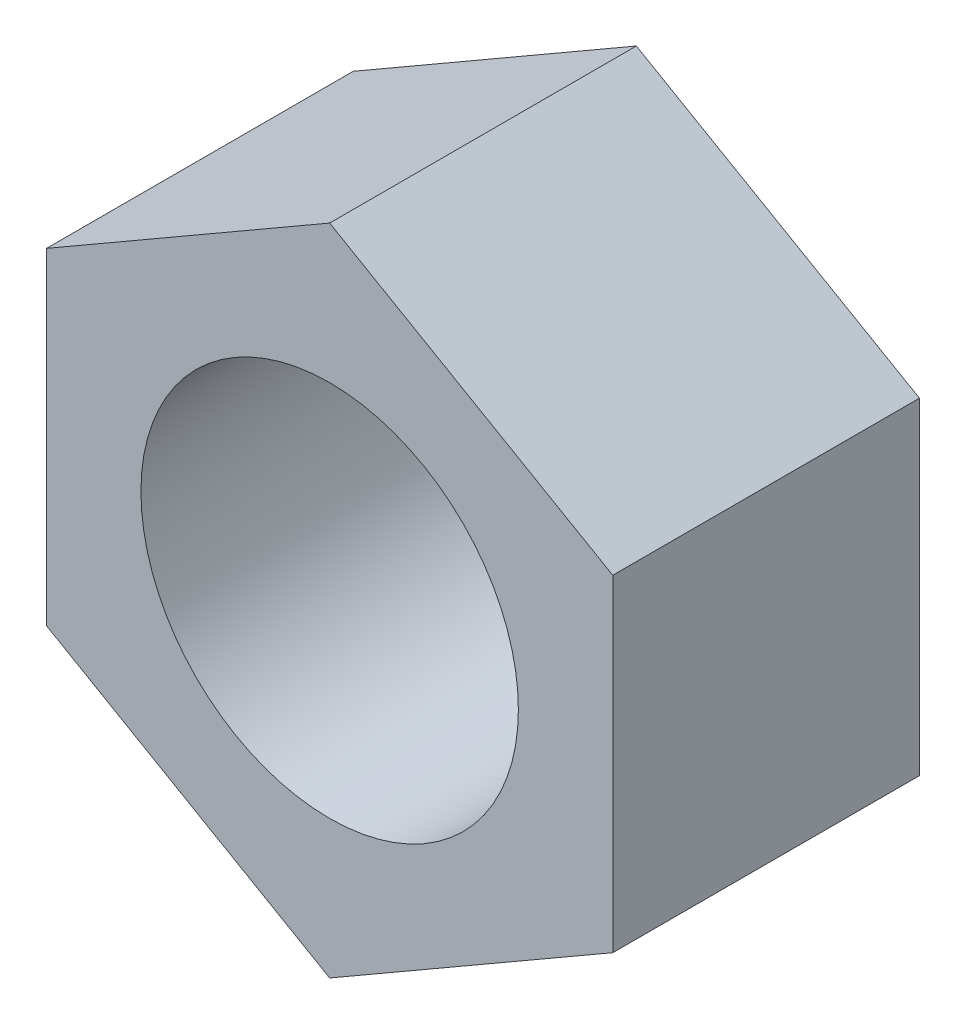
ISO-10303-21;
HEADER;
FILE_DESCRIPTION(('STEP AP214'),'2;1');
FILE_NAME('part.step','',(''),(''),'','','');
FILE_SCHEMA(('AUTOMOTIVE_DESIGN { 1 0 10303 214 1 1 1 1 }'));
ENDSEC;
DATA;
#1=APPLICATION_CONTEXT('core data for automotive mechanical design processes');
#2=APPLICATION_PROTOCOL_DEFINITION('international standard','automotive_design',2000,#1);
#3=PRODUCT_CONTEXT('',#1,'mechanical');
#4=PRODUCT('Part','Part','',(#3));
#5=PRODUCT_RELATED_PRODUCT_CATEGORY('part','',(#4));
#6=PRODUCT_DEFINITION_FORMATION('','',#4);
#7=PRODUCT_DEFINITION_CONTEXT('part definition',#1,'design');
#8=PRODUCT_DEFINITION('design','',#6,#7);
#9=PRODUCT_DEFINITION_SHAPE('','',#8);
#10=(LENGTH_UNIT() NAMED_UNIT(*) SI_UNIT(.MILLI.,.METRE.));
#11=(NAMED_UNIT(*) PLANE_ANGLE_UNIT() SI_UNIT($,.RADIAN.));
#12=(NAMED_UNIT(*) SI_UNIT($,.STERADIAN.) SOLID_ANGLE_UNIT());
#13=UNCERTAINTY_MEASURE_WITH_UNIT(LENGTH_MEASURE(1.E-05),#10,'distance_accuracy_value','');
#14=(GEOMETRIC_REPRESENTATION_CONTEXT(3) GLOBAL_UNCERTAINTY_ASSIGNED_CONTEXT((#13)) GLOBAL_UNIT_ASSIGNED_CONTEXT((#10,
#11,#12)) REPRESENTATION_CONTEXT('',''));
#15=CARTESIAN_POINT('',(0.,0.,0.));
#16=DIRECTION('',(0.,0.,1.));
#17=DIRECTION('',(1.,0.,0.));
#18=AXIS2_PLACEMENT_3D('',#15,#16,#17);
#19=CARTESIAN_POINT('',(-12.,-6.92820323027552,13.));
#20=DIRECTION('',(0.,0.,-1.));
#21=DIRECTION('',(0.866025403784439,-0.5,0.));
#22=AXIS2_PLACEMENT_3D('',#19,#20,#21);
#23=PLANE('',#22);
#24=DIRECTION('',(-0.866025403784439,0.5,0.));
#25=VECTOR('',#24,1.);
#26=CARTESIAN_POINT('',(0.,-13.856406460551,13.));
#27=LINE('',#26,#25);
#28=CARTESIAN_POINT('',(0.,-13.856406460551,13.));
#29=VERTEX_POINT('',#28);
#30=CARTESIAN_POINT('',(-12.,-6.92820323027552,13.));
#31=VERTEX_POINT('',#30);
#32=EDGE_CURVE('E87',#29,#31,#27,.T.);
#33=ORIENTED_EDGE('',*,*,#32,.F.);
#34=DIRECTION('',(0.866025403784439,0.5,0.));
#35=VECTOR('',#34,1.);
#36=CARTESIAN_POINT('',(0.,-13.856406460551,13.));
#37=LINE('',#36,#35);
#38=CARTESIAN_POINT('',(12.,-6.92820323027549,13.));
#39=VERTEX_POINT('',#38);
#40=EDGE_CURVE('E82',#29,#39,#37,.T.);
#41=ORIENTED_EDGE('',*,*,#40,.T.);
#42=DIRECTION('',(0.,-1.,0.));
#43=VECTOR('',#42,1.);
#44=CARTESIAN_POINT('',(12.,6.92820323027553,13.));
#45=LINE('',#44,#43);
#46=CARTESIAN_POINT('',(12.,6.92820323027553,13.));
#47=VERTEX_POINT('',#46);
#48=EDGE_CURVE('E80',#47,#39,#45,.T.);
#49=ORIENTED_EDGE('',*,*,#48,.F.);
#50=DIRECTION('',(-0.866025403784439,0.5,0.));
#51=VECTOR('',#50,1.);
#52=CARTESIAN_POINT('',(12.,6.92820323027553,13.));
#53=LINE('',#52,#51);
#54=CARTESIAN_POINT('',(0.,13.856406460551,13.));
#55=VERTEX_POINT('',#54);
#56=EDGE_CURVE('E57',#47,#55,#53,.T.);
#57=ORIENTED_EDGE('',*,*,#56,.T.);
#58=DIRECTION('',(-0.866025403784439,-0.5,0.));
#59=VECTOR('',#58,1.);
#60=CARTESIAN_POINT('',(0.,13.856406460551,13.));
#61=LINE('',#60,#59);
#62=CARTESIAN_POINT('',(-12.,6.92820323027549,13.));
#63=VERTEX_POINT('',#62);
#64=EDGE_CURVE('E69',#55,#63,#61,.T.);
#65=ORIENTED_EDGE('',*,*,#64,.T.);
#66=DIRECTION('',(0.,1.,0.));
#67=VECTOR('',#66,1.);
#68=CARTESIAN_POINT('',(-12.,-6.92820323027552,13.));
#69=LINE('',#68,#67);
#70=EDGE_CURVE('E74',#31,#63,#69,.T.);
#71=ORIENTED_EDGE('',*,*,#70,.F.);
#72=EDGE_LOOP('',(#33,#41,#49,#57,#65,#71));
#73=FACE_BOUND('',#72,.T.);
#74=CARTESIAN_POINT('',(0.,0.,13.));
#75=DIRECTION('',(0.,0.,1.));
#76=DIRECTION('',(-0.866025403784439,0.5,0.));
#77=AXIS2_PLACEMENT_3D('',#74,#75,#76);
#78=CIRCLE('',#77,8.);
#79=CARTESIAN_POINT('',(-6.92820323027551,4.,13.));
#80=VERTEX_POINT('',#79);
#81=EDGE_CURVE('E110',#80,#80,#78,.T.);
#82=ORIENTED_EDGE('',*,*,#81,.F.);
#83=EDGE_LOOP('',(#82));
#84=FACE_BOUND('',#83,.T.);
#85=ADVANCED_FACE('F14',(#73,#84),#23,.F.);
#86=CARTESIAN_POINT('',(-12.,-6.92820323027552,0.));
#87=DIRECTION('',(0.,0.,-1.));
#88=DIRECTION('',(0.866025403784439,-0.5,0.));
#89=AXIS2_PLACEMENT_3D('',#86,#87,#88);
#90=PLANE('',#89);
#91=DIRECTION('',(-0.866025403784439,0.5,0.));
#92=VECTOR('',#91,1.);
#93=CARTESIAN_POINT('',(0.,-13.856406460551,0.));
#94=LINE('',#93,#92);
#95=CARTESIAN_POINT('',(0.,-13.856406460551,0.));
#96=VERTEX_POINT('',#95);
#97=CARTESIAN_POINT('',(-12.,-6.92820323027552,0.));
#98=VERTEX_POINT('',#97);
#99=EDGE_CURVE('E124',#96,#98,#94,.T.);
#100=ORIENTED_EDGE('',*,*,#99,.T.);
#101=DIRECTION('',(0.,1.,0.));
#102=VECTOR('',#101,1.);
#103=CARTESIAN_POINT('',(-12.,-6.92820323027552,0.));
#104=LINE('',#103,#102);
#105=CARTESIAN_POINT('',(-12.,6.92820323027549,0.));
#106=VERTEX_POINT('',#105);
#107=EDGE_CURVE('E125',#98,#106,#104,.T.);
#108=ORIENTED_EDGE('',*,*,#107,.T.);
#109=DIRECTION('',(-0.866025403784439,-0.5,0.));
#110=VECTOR('',#109,1.);
#111=CARTESIAN_POINT('',(0.,13.856406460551,0.));
#112=LINE('',#111,#110);
#113=CARTESIAN_POINT('',(0.,13.856406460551,0.));
#114=VERTEX_POINT('',#113);
#115=EDGE_CURVE('E117',#114,#106,#112,.T.);
#116=ORIENTED_EDGE('',*,*,#115,.F.);
#117=DIRECTION('',(-0.866025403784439,0.5,0.));
#118=VECTOR('',#117,1.);
#119=CARTESIAN_POINT('',(12.,6.92820323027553,0.));
#120=LINE('',#119,#118);
#121=CARTESIAN_POINT('',(12.,6.92820323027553,0.));
#122=VERTEX_POINT('',#121);
#123=EDGE_CURVE('E61',#122,#114,#120,.T.);
#124=ORIENTED_EDGE('',*,*,#123,.F.);
#125=DIRECTION('',(0.,-1.,0.));
#126=VECTOR('',#125,1.);
#127=CARTESIAN_POINT('',(12.,6.92820323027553,0.));
#128=LINE('',#127,#126);
#129=CARTESIAN_POINT('',(12.,-6.92820323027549,0.));
#130=VERTEX_POINT('',#129);
#131=EDGE_CURVE('E96',#122,#130,#128,.T.);
#132=ORIENTED_EDGE('',*,*,#131,.T.);
#133=DIRECTION('',(0.866025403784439,0.5,0.));
#134=VECTOR('',#133,1.);
#135=CARTESIAN_POINT('',(0.,-13.856406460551,0.));
#136=LINE('',#135,#134);
#137=EDGE_CURVE('E107',#96,#130,#136,.T.);
#138=ORIENTED_EDGE('',*,*,#137,.F.);
#139=EDGE_LOOP('',(#100,#108,#116,#124,#132,#138));
#140=FACE_BOUND('',#139,.T.);
#141=CARTESIAN_POINT('',(0.,0.,0.));
#142=DIRECTION('',(0.,0.,1.));
#143=DIRECTION('',(-0.866025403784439,0.5,0.));
#144=AXIS2_PLACEMENT_3D('',#141,#142,#143);
#145=CIRCLE('',#144,8.);
#146=CARTESIAN_POINT('',(-6.92820323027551,4.,0.));
#147=VERTEX_POINT('',#146);
#148=EDGE_CURVE('E113',#147,#147,#145,.T.);
#149=ORIENTED_EDGE('',*,*,#148,.T.);
#150=EDGE_LOOP('',(#149));
#151=FACE_BOUND('',#150,.T.);
#152=ADVANCED_FACE('F105',(#140,#151),#90,.T.);
#153=CARTESIAN_POINT('',(0.,-13.856406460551,13.));
#154=DIRECTION('',(-0.5,-0.866025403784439,0.));
#155=DIRECTION('',(0.,0.,1.));
#156=AXIS2_PLACEMENT_3D('',#153,#154,#155);
#157=PLANE('',#156);
#158=DIRECTION('',(0.,0.,-1.));
#159=VECTOR('',#158,1.);
#160=CARTESIAN_POINT('',(0.,-13.856406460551,13.));
#161=LINE('',#160,#159);
#162=EDGE_CURVE('E9',#29,#96,#161,.T.);
#163=ORIENTED_EDGE('',*,*,#162,.F.);
#164=ORIENTED_EDGE('',*,*,#32,.T.);
#165=DIRECTION('',(0.,0.,-1.));
#166=VECTOR('',#165,1.);
#167=CARTESIAN_POINT('',(-12.,-6.92820323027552,13.));
#168=LINE('',#167,#166);
#169=EDGE_CURVE('E30',#31,#98,#168,.T.);
#170=ORIENTED_EDGE('',*,*,#169,.T.);
#171=ORIENTED_EDGE('',*,*,#99,.F.);
#172=EDGE_LOOP('',(#163,#164,#170,#171));
#173=FACE_BOUND('',#172,.T.);
#174=ADVANCED_FACE('F148',(#173),#157,.T.);
#175=CARTESIAN_POINT('',(0.,-13.856406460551,13.));
#176=DIRECTION('',(-0.5,0.866025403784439,0.));
#177=DIRECTION('',(-0.866025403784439,-0.5,0.));
#178=AXIS2_PLACEMENT_3D('',#175,#176,#177);
#179=PLANE('',#178);
#180=DIRECTION('',(0.,0.,-1.));
#181=VECTOR('',#180,1.);
#182=CARTESIAN_POINT('',(12.,-6.92820323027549,13.));
#183=LINE('',#182,#181);
#184=EDGE_CURVE('E23',#39,#130,#183,.T.);
#185=ORIENTED_EDGE('',*,*,#184,.F.);
#186=ORIENTED_EDGE('',*,*,#40,.F.);
#187=ORIENTED_EDGE('',*,*,#162,.T.);
#188=ORIENTED_EDGE('',*,*,#137,.T.);
#189=EDGE_LOOP('',(#185,#186,#187,#188));
#190=FACE_BOUND('',#189,.T.);
#191=ADVANCED_FACE('F16',(#190),#179,.F.);
#192=CARTESIAN_POINT('',(12.,6.92820323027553,13.));
#193=DIRECTION('',(1.,0.,0.));
#194=DIRECTION('',(0.,1.,0.));
#195=AXIS2_PLACEMENT_3D('',#192,#193,#194);
#196=PLANE('',#195);
#197=DIRECTION('',(0.,0.,-1.));
#198=VECTOR('',#197,1.);
#199=CARTESIAN_POINT('',(12.,6.92820323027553,13.));
#200=LINE('',#199,#198);
#201=EDGE_CURVE('E65',#47,#122,#200,.T.);
#202=ORIENTED_EDGE('',*,*,#201,.F.);
#203=ORIENTED_EDGE('',*,*,#48,.T.);
#204=ORIENTED_EDGE('',*,*,#184,.T.);
#205=ORIENTED_EDGE('',*,*,#131,.F.);
#206=EDGE_LOOP('',(#202,#203,#204,#205));
#207=FACE_BOUND('',#206,.T.);
#208=ADVANCED_FACE('F94',(#207),#196,.T.);
#209=CARTESIAN_POINT('',(12.,6.92820323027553,13.));
#210=DIRECTION('',(-0.5,-0.866025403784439,0.));
#211=DIRECTION('',(0.,0.,1.));
#212=AXIS2_PLACEMENT_3D('',#209,#210,#211);
#213=PLANE('',#212);
#214=DIRECTION('',(0.,0.,-1.));
#215=VECTOR('',#214,1.);
#216=CARTESIAN_POINT('',(0.,13.856406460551,13.));
#217=LINE('',#216,#215);
#218=EDGE_CURVE('E52',#55,#114,#217,.T.);
#219=ORIENTED_EDGE('',*,*,#218,.F.);
#220=ORIENTED_EDGE('',*,*,#56,.F.);
#221=ORIENTED_EDGE('',*,*,#201,.T.);
#222=ORIENTED_EDGE('',*,*,#123,.T.);
#223=EDGE_LOOP('',(#219,#220,#221,#222));
#224=FACE_BOUND('',#223,.T.);
#225=ADVANCED_FACE('F54',(#224),#213,.F.);
#226=CARTESIAN_POINT('',(0.,13.856406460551,13.));
#227=DIRECTION('',(0.5,-0.866025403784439,0.));
#228=DIRECTION('',(0.866025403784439,0.5,0.));
#229=AXIS2_PLACEMENT_3D('',#226,#227,#228);
#230=PLANE('',#229);
#231=DIRECTION('',(0.,0.,-1.));
#232=VECTOR('',#231,1.);
#233=CARTESIAN_POINT('',(-12.,6.92820323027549,13.));
#234=LINE('',#233,#232);
#235=EDGE_CURVE('E66',#63,#106,#234,.T.);
#236=ORIENTED_EDGE('',*,*,#235,.F.);
#237=ORIENTED_EDGE('',*,*,#64,.F.);
#238=ORIENTED_EDGE('',*,*,#218,.T.);
#239=ORIENTED_EDGE('',*,*,#115,.T.);
#240=EDGE_LOOP('',(#236,#237,#238,#239));
#241=FACE_BOUND('',#240,.T.);
#242=ADVANCED_FACE('F70',(#241),#230,.F.);
#243=CARTESIAN_POINT('',(-12.,-6.92820323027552,13.));
#244=DIRECTION('',(-1.,0.,0.));
#245=DIRECTION('',(0.,-1.,0.));
#246=AXIS2_PLACEMENT_3D('',#243,#244,#245);
#247=PLANE('',#246);
#248=ORIENTED_EDGE('',*,*,#70,.T.);
#249=ORIENTED_EDGE('',*,*,#235,.T.);
#250=ORIENTED_EDGE('',*,*,#107,.F.);
#251=ORIENTED_EDGE('',*,*,#169,.F.);
#252=EDGE_LOOP('',(#248,#249,#250,#251));
#253=FACE_BOUND('',#252,.T.);
#254=ADVANCED_FACE('F121',(#253),#247,.T.);
#255=CARTESIAN_POINT('',(0.,0.,13.));
#256=DIRECTION('',(0.,0.,-1.));
#257=DIRECTION('',(0.866025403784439,-0.5,0.));
#258=AXIS2_PLACEMENT_3D('',#255,#256,#257);
#259=CYLINDRICAL_SURFACE('',#258,8.);
#260=ORIENTED_EDGE('',*,*,#81,.T.);
#261=EDGE_LOOP('',(#260));
#262=FACE_BOUND('',#261,.T.);
#263=ORIENTED_EDGE('',*,*,#148,.F.);
#264=EDGE_LOOP('',(#263));
#265=FACE_BOUND('',#264,.T.);
#266=ADVANCED_FACE('F131',(#262,#265),#259,.F.);
#267=CLOSED_SHELL('',(#85,#152,#174,#191,#208,#225,#242,#254,#266));
#268=MANIFOLD_SOLID_BREP('B1',#267);
#269=ADVANCED_BREP_SHAPE_REPRESENTATION('',(#18,#268),#14);
#270=SHAPE_DEFINITION_REPRESENTATION(#9,#269);
ENDSEC;
END-ISO-10303-21;
